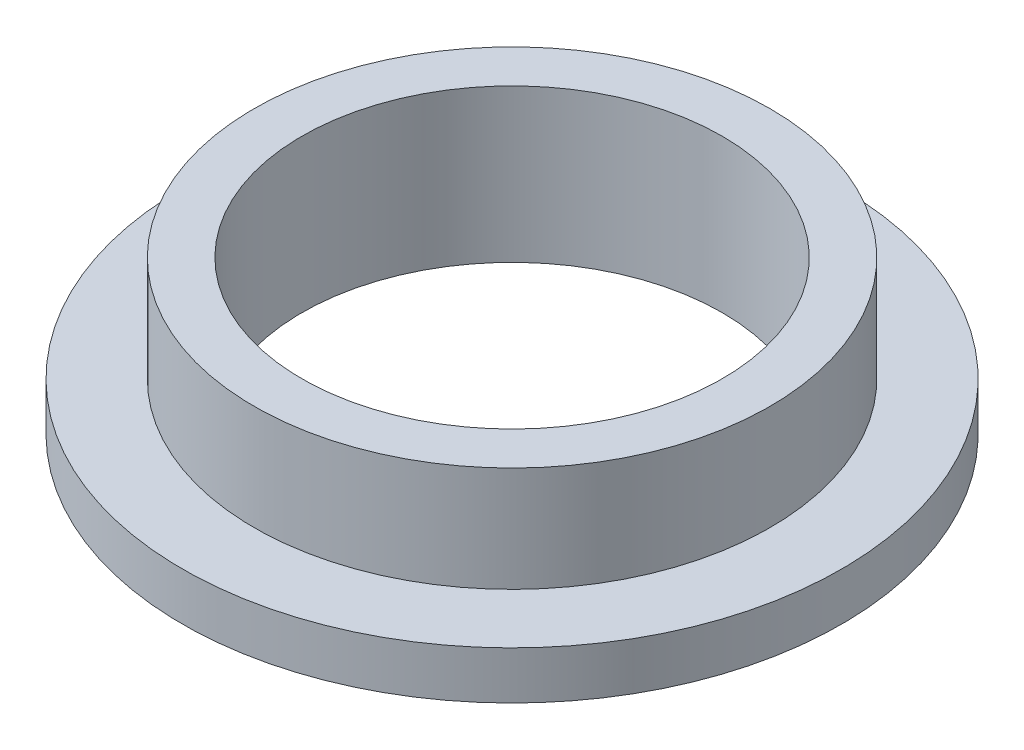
from build123d import *


with BuildPart() as part:
    # Esquisse1 → R_volution1 (revolve)
    with BuildSketch(Plane.XY, mode=Mode.PRIVATE) as r_volution1_sk:
        Polygon((3.45, 0), (2.2, 0), (2.2, 1.6), (2.7, 1.6), (2.7, 0.5), (3.45, 0.5), align=None)
    revolve(r_volution1_sk.sketch.rotate(Axis((0, 0, 0), (0, 1, 0)), 90), axis=Axis((0, 0, 0), (0, 1, 0)))


solid = part.part
